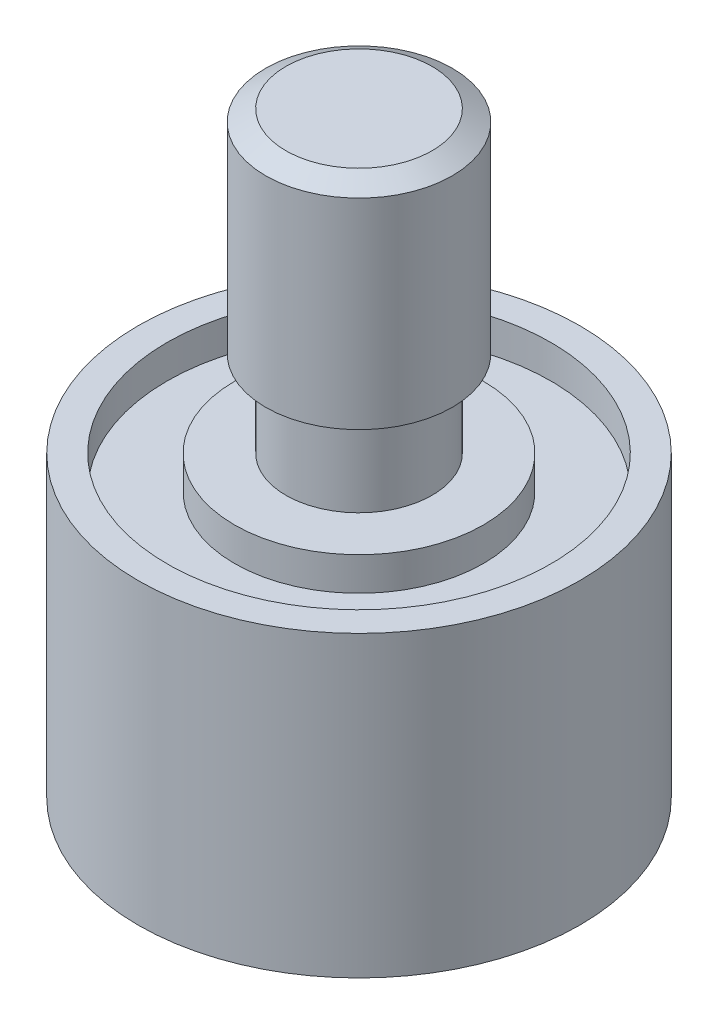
from build123d import *

# Parameters (mm, degrees)
F_38_0_1015_DIAMETER_HOLE1_D     = 2.5781
F_38_0_1015_DIAMETER_HOLE1_DEPTH = 4.5466
F_38_0_1015_DIAMETER_HOLE1_TIP   = 0.774539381


with BuildPart() as part:
    # Sketch1 → Revolve1 (revolve)
    with BuildSketch(Plane.XY, mode=Mode.PRIVATE) as revolve1_sk:
        Polygon((3.1115, 0), (5.2959, 0), (5.2959, -1.4224), (8.1661, -1.4224), (8.1661, 0), (9.398, 0), (9.398, -12.7), (0, -12.7), (0, 0), (0, 12.7), (3.1115, 12.7), (3.96875, 12.205066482), (3.96875, 3.669933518), (3.1115, 3.175), align=None)
    revolve(revolve1_sk.sketch.rotate(Axis((0, 0, 0), (0, -1, 0)), 180), axis=Axis((0, 0, 0), (0, -1, 0)))

    # 38 _0.1015_ Diameter Hole1
    with Locations(Plane(origin=(0, -12.7, 0), x_dir=(-1, 0, 0), z_dir=(0, -1, 0))):
        with Locations((-6.3246, 0), (6.3246, 0)):
            Hole(F_38_0_1015_DIAMETER_HOLE1_D / 2, depth=F_38_0_1015_DIAMETER_HOLE1_DEPTH)
            with Locations((0, 0, -(F_38_0_1015_DIAMETER_HOLE1_DEPTH + F_38_0_1015_DIAMETER_HOLE1_TIP / 2))):  # 118° drill point
                Cone(0, F_38_0_1015_DIAMETER_HOLE1_D / 2, F_38_0_1015_DIAMETER_HOLE1_TIP, mode=Mode.SUBTRACT)


solid = part.part
